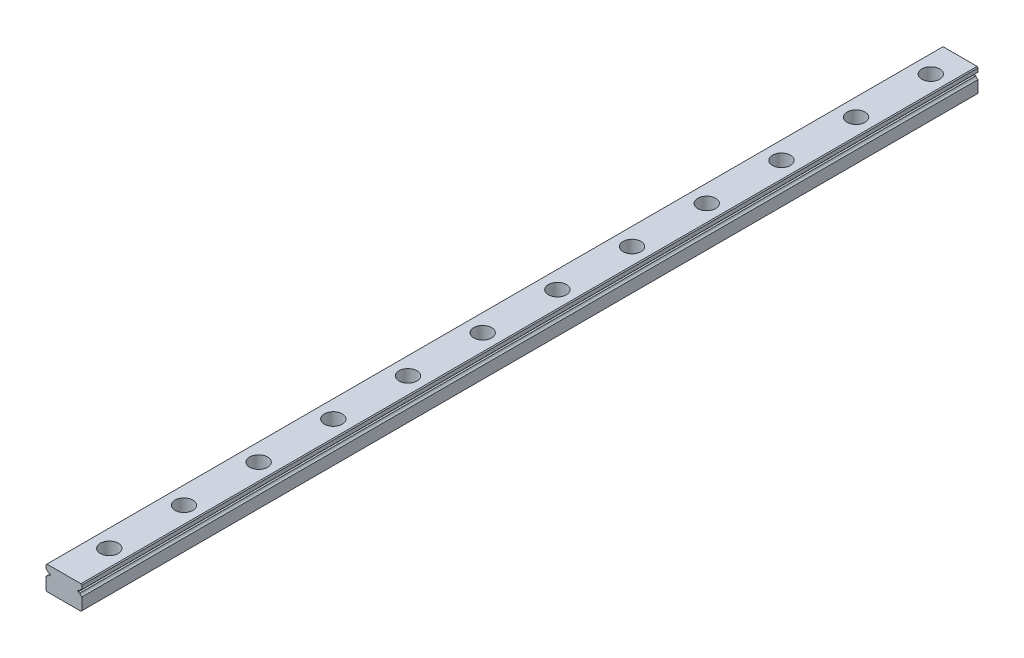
from build123d import *

# Parameters (mm, degrees)
EXTRUDE_1_DEPTH        = 300
SKETCH_2_R             = 3
SKETCH_2_R_2           = 1.75
CUT_EXTRUDE_1_DEPTH    = 4.5
SKETCH_2_2_R           = 1.75
CUT_EXTRUDE_2_DEPTH    = 301.166620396
PATTERN_LINEAR_1_COUNT = 12
PATTERN_LINEAR_1_PITCH = 25


with BuildPart() as part:
    # Sketch 1 → Extrude 1 (new body)
    with BuildSketch(Plane.XY):
        with BuildLine():
            Line((-6, 3.7), (-5.7, 4))
            Line((-5.7, 4), (5.7, 4))
            Line((5.7, 4), (6, 3.7))
            Line((6, 3.7), (6, 2.449776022))
            ThreePointArc((6, 2.449776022), (5.561887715, 2.168810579), (5.297911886, 1.720256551))
            Line((5.297911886, 1.720256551), (4.687472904, 1.720256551))
            Line((4.687472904, 1.720256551), (4.687472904, 1.082255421))
            Line((4.687472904, 1.082255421), (5.292171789, 1.082255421))
            ThreePointArc((5.292171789, 1.082255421), (5.554928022, 0.621665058), (6, 0.333402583))
            Line((6, 0.333402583), (6, -3.7))
            Line((6, -3.7), (5.7, -4))
            Line((5.7, -4), (-5.7, -4))
            Line((-5.7, -4), (-6, -3.7))
            Line((-6, -3.7), (-6, 0.333402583))
            ThreePointArc((-6, 0.333402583), (-5.554928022, 0.621665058), (-5.292171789, 1.082255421))
            Line((-5.292171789, 1.082255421), (-4.687472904, 1.082255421))
            Line((-4.687472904, 1.082255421), (-4.687472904, 1.720256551))
            Line((-4.687472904, 1.720256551), (-5.297911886, 1.720256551))
            ThreePointArc((-5.297911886, 1.720256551), (-5.561887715, 2.168810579), (-6, 2.449776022))
            Line((-6, 2.449776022), (-6, 3.7))
        make_face()
    extrude(amount=EXTRUDE_1_DEPTH)

    # Sketch 2 → Cut-Extrude 1 (cut)
    with BuildSketch(Plane(origin=(0, 4, 0), x_dir=(1, 0, 0), z_dir=(0, 1, 0))):
        with Locations(Location((0.188190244, -10, 0), (0, 0, 270))):
            Circle(SKETCH_2_R)
        with Locations(Location((0.188190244, -10, 0), (0, 0, 270))):
            Circle(SKETCH_2_R_2, mode=Mode.SUBTRACT)
    cut_extrude_1 = extrude(amount=-CUT_EXTRUDE_1_DEPTH, mode=Mode.SUBTRACT)

    # Sketch 2_2 → Cut-Extrude 2 (cut, through all)
    with BuildSketch(Plane(origin=(0, 4, 0), x_dir=(1, 0, 0), z_dir=(0, 1, 0))):
        with Locations(Location((0.188190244, -10, 0), (0, 0, 270))):
            Circle(SKETCH_2_2_R)
    cut_extrude_2 = extrude(amount=-CUT_EXTRUDE_2_DEPTH, mode=Mode.SUBTRACT)

    # Pattern Linear 1: Cut-Extrude 1, Cut-Extrude 2 ×12
    with Locations(*[(0, 0, i * PATTERN_LINEAR_1_PITCH) for i in range(1, PATTERN_LINEAR_1_COUNT)]):
        add(cut_extrude_1, mode=Mode.SUBTRACT)
        add(cut_extrude_2, mode=Mode.SUBTRACT)


solid = part.part
